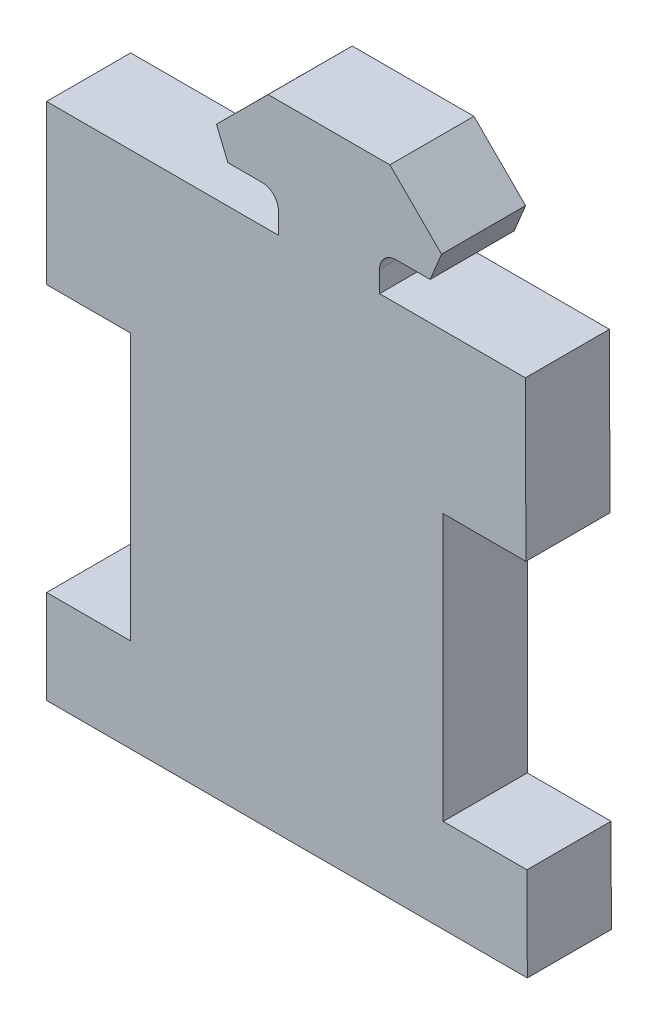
ISO-10303-21;
HEADER;
FILE_DESCRIPTION(('STEP AP214'),'2;1');
FILE_NAME('part.step','',(''),(''),'','','');
FILE_SCHEMA(('AUTOMOTIVE_DESIGN { 1 0 10303 214 1 1 1 1 }'));
ENDSEC;
DATA;
#1=APPLICATION_CONTEXT('core data for automotive mechanical design processes');
#2=APPLICATION_PROTOCOL_DEFINITION('international standard','automotive_design',2000,#1);
#3=PRODUCT_CONTEXT('',#1,'mechanical');
#4=PRODUCT('Part','Part','',(#3));
#5=PRODUCT_RELATED_PRODUCT_CATEGORY('part','',(#4));
#6=PRODUCT_DEFINITION_FORMATION('','',#4);
#7=PRODUCT_DEFINITION_CONTEXT('part definition',#1,'design');
#8=PRODUCT_DEFINITION('design','',#6,#7);
#9=PRODUCT_DEFINITION_SHAPE('','',#8);
#10=(LENGTH_UNIT() NAMED_UNIT(*) SI_UNIT(.MILLI.,.METRE.));
#11=(NAMED_UNIT(*) PLANE_ANGLE_UNIT() SI_UNIT($,.RADIAN.));
#12=(NAMED_UNIT(*) SI_UNIT($,.STERADIAN.) SOLID_ANGLE_UNIT());
#13=UNCERTAINTY_MEASURE_WITH_UNIT(LENGTH_MEASURE(1.E-05),#10,'distance_accuracy_value','');
#14=(GEOMETRIC_REPRESENTATION_CONTEXT(3) GLOBAL_UNCERTAINTY_ASSIGNED_CONTEXT((#13)) GLOBAL_UNIT_ASSIGNED_CONTEXT((#10,
#11,#12)) REPRESENTATION_CONTEXT('',''));
#15=CARTESIAN_POINT('',(0.,0.,0.));
#16=DIRECTION('',(0.,0.,1.));
#17=DIRECTION('',(1.,0.,0.));
#18=AXIS2_PLACEMENT_3D('',#15,#16,#17);
#19=CARTESIAN_POINT('',(-458.518450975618,-728.410011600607,5.3848));
#20=DIRECTION('',(1.,0.,0.));
#21=DIRECTION('',(0.,0.,-1.));
#22=AXIS2_PLACEMENT_3D('',#19,#20,#21);
#23=PLANE('',#22);
#24=DIRECTION('',(0.,-1.,0.));
#25=VECTOR('',#24,1.);
#26=CARTESIAN_POINT('',(-458.518450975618,-728.410011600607,5.3848));
#27=LINE('',#26,#25);
#28=CARTESIAN_POINT('',(-458.518450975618,-755.842088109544,5.3848));
#29=VERTEX_POINT('',#28);
#30=CARTESIAN_POINT('',(-458.518450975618,-761.832335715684,5.3848));
#31=VERTEX_POINT('',#30);
#32=EDGE_CURVE('E279',#29,#31,#27,.T.);
#33=ORIENTED_EDGE('',*,*,#32,.F.);
#34=DIRECTION('',(0.,0.,-1.));
#35=VECTOR('',#34,1.);
#36=CARTESIAN_POINT('',(-458.518450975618,-755.842088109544,23.2873866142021));
#37=LINE('',#36,#35);
#38=CARTESIAN_POINT('',(-458.518450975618,-755.842088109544,0.));
#39=VERTEX_POINT('',#38);
#40=EDGE_CURVE('E201',#29,#39,#37,.T.);
#41=ORIENTED_EDGE('',*,*,#40,.T.);
#42=DIRECTION('',(0.,-1.,0.));
#43=VECTOR('',#42,1.);
#44=CARTESIAN_POINT('',(-458.518450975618,-728.410011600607,0.));
#45=LINE('',#44,#43);
#46=CARTESIAN_POINT('',(-458.518450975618,-761.832335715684,0.));
#47=VERTEX_POINT('',#46);
#48=EDGE_CURVE('E275',#39,#47,#45,.T.);
#49=ORIENTED_EDGE('',*,*,#48,.T.);
#50=DIRECTION('',(0.,0.,-1.));
#51=VECTOR('',#50,1.);
#52=CARTESIAN_POINT('',(-458.518450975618,-761.832335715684,5.3848));
#53=LINE('',#52,#51);
#54=EDGE_CURVE('E40',#31,#47,#53,.T.);
#55=ORIENTED_EDGE('',*,*,#54,.F.);
#56=EDGE_LOOP('',(#33,#41,#49,#55));
#57=FACE_BOUND('',#56,.T.);
#58=ADVANCED_FACE('F32',(#57),#23,.F.);
#59=CARTESIAN_POINT('',(-427.733650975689,-761.832335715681,5.3848));
#60=DIRECTION('',(-0.999992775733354,-0.00380111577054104,0.));
#61=DIRECTION('',(0.00380111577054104,-0.999992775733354,0.));
#62=AXIS2_PLACEMENT_3D('',#59,#60,#61);
#63=PLANE('',#62);
#64=DIRECTION('',(-0.00380111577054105,0.999992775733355,0.));
#65=VECTOR('',#64,1.);
#66=CARTESIAN_POINT('',(-427.733650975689,-761.832335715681,0.));
#67=LINE('',#66,#65);
#68=CARTESIAN_POINT('',(-427.733650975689,-761.832335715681,0.));
#69=VERTEX_POINT('',#68);
#70=CARTESIAN_POINT('',(-427.756420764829,-755.842088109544,0.));
#71=VERTEX_POINT('',#70);
#72=EDGE_CURVE('E321',#69,#71,#67,.T.);
#73=ORIENTED_EDGE('',*,*,#72,.T.);
#74=DIRECTION('',(0.,0.,1.));
#75=VECTOR('',#74,1.);
#76=CARTESIAN_POINT('',(-427.756420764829,-755.842088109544,5.3848));
#77=LINE('',#76,#75);
#78=CARTESIAN_POINT('',(-427.756420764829,-755.842088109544,5.3848));
#79=VERTEX_POINT('',#78);
#80=EDGE_CURVE('E258',#71,#79,#77,.T.);
#81=ORIENTED_EDGE('',*,*,#80,.T.);
#82=DIRECTION('',(-0.00380111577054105,0.999992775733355,0.));
#83=VECTOR('',#82,1.);
#84=CARTESIAN_POINT('',(-427.733650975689,-761.832335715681,5.3848));
#85=LINE('',#84,#83);
#86=CARTESIAN_POINT('',(-427.733650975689,-761.832335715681,5.3848));
#87=VERTEX_POINT('',#86);
#88=EDGE_CURVE('E283',#87,#79,#85,.T.);
#89=ORIENTED_EDGE('',*,*,#88,.F.);
#90=DIRECTION('',(0.,0.,-1.));
#91=VECTOR('',#90,1.);
#92=CARTESIAN_POINT('',(-427.733650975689,-761.832335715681,5.3848));
#93=LINE('',#92,#91);
#94=EDGE_CURVE('E374',#87,#69,#93,.T.);
#95=ORIENTED_EDGE('',*,*,#94,.T.);
#96=EDGE_LOOP('',(#73,#81,#89,#95));
#97=FACE_BOUND('',#96,.T.);
#98=ADVANCED_FACE('F389',(#97),#63,.F.);
#99=CARTESIAN_POINT('',(-436.146138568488,-727.249300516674,0.));
#100=DIRECTION('',(0.,0.,1.));
#101=DIRECTION('',(1.,0.,0.));
#102=AXIS2_PLACEMENT_3D('',#99,#100,#101);
#103=PLANE('',#102);
#104=ORIENTED_EDGE('',*,*,#48,.F.);
#105=DIRECTION('',(-1.,0.,0.));
#106=VECTOR('',#105,1.);
#107=CARTESIAN_POINT('',(-458.518450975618,-755.842088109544,0.));
#108=LINE('',#107,#106);
#109=CARTESIAN_POINT('',(-453.133650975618,-755.842088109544,0.));
#110=VERTEX_POINT('',#109);
#111=EDGE_CURVE('E217',#110,#39,#108,.T.);
#112=ORIENTED_EDGE('',*,*,#111,.F.);
#113=DIRECTION('',(0.,-1.,0.));
#114=VECTOR('',#113,1.);
#115=CARTESIAN_POINT('',(-453.133650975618,-755.842088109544,0.));
#116=LINE('',#115,#114);
#117=CARTESIAN_POINT('',(-453.133650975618,-738.768525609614,0.));
#118=VERTEX_POINT('',#117);
#119=EDGE_CURVE('E211',#118,#110,#116,.T.);
#120=ORIENTED_EDGE('',*,*,#119,.F.);
#121=DIRECTION('',(1.,0.,0.));
#122=VECTOR('',#121,1.);
#123=CARTESIAN_POINT('',(-453.133650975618,-738.768525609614,0.));
#124=LINE('',#123,#122);
#125=CARTESIAN_POINT('',(-458.518450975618,-738.768525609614,0.));
#126=VERTEX_POINT('',#125);
#127=EDGE_CURVE('E222',#126,#118,#124,.T.);
#128=ORIENTED_EDGE('',*,*,#127,.F.);
#129=CARTESIAN_POINT('',(-458.518450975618,-728.608525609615,0.));
#130=VERTEX_POINT('',#129);
#131=EDGE_CURVE('E314',#130,#126,#45,.T.);
#132=ORIENTED_EDGE('',*,*,#131,.F.);
#133=DIRECTION('',(-1.,0.,0.));
#134=VECTOR('',#133,1.);
#135=CARTESIAN_POINT('',(-458.518450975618,-728.608525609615,0.));
#136=LINE('',#135,#134);
#137=CARTESIAN_POINT('',(-443.672150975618,-728.608525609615,0.));
#138=VERTEX_POINT('',#137);
#139=EDGE_CURVE('E229',#138,#130,#136,.T.);
#140=ORIENTED_EDGE('',*,*,#139,.F.);
#141=DIRECTION('',(0.,-1.,0.));
#142=VECTOR('',#141,1.);
#143=CARTESIAN_POINT('',(-443.672150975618,-727.249300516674,0.));
#144=LINE('',#143,#142);
#145=CARTESIAN_POINT('',(-443.672150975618,-727.249300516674,0.));
#146=VERTEX_POINT('',#145);
#147=EDGE_CURVE('E350',#146,#138,#144,.T.);
#148=ORIENTED_EDGE('',*,*,#147,.F.);
#149=CARTESIAN_POINT('',(-444.721163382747,-727.249300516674,0.));
#150=DIRECTION('',(0.,0.,-1.));
#151=DIRECTION('',(-1.,0.,0.));
#152=AXIS2_PLACEMENT_3D('',#149,#150,#151);
#153=CIRCLE('',#152,1.04901240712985);
#154=CARTESIAN_POINT('',(-444.721163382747,-726.200288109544,0.));
#155=VERTEX_POINT('',#154);
#156=EDGE_CURVE('E348',#155,#146,#153,.T.);
#157=ORIENTED_EDGE('',*,*,#156,.F.);
#158=DIRECTION('',(-1.,0.,0.));
#159=VECTOR('',#158,1.);
#160=CARTESIAN_POINT('',(-444.721163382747,-726.200288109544,0.));
#161=LINE('',#160,#159);
#162=CARTESIAN_POINT('',(-446.910439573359,-726.200288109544,0.));
#163=VERTEX_POINT('',#162);
#164=EDGE_CURVE('E345',#155,#163,#161,.T.);
#165=ORIENTED_EDGE('',*,*,#164,.T.);
#166=DIRECTION('',(-0.382154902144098,0.924098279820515,0.));
#167=VECTOR('',#166,1.);
#168=CARTESIAN_POINT('',(-446.910439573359,-726.200288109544,0.));
#169=LINE('',#168,#167);
#170=CARTESIAN_POINT('',(-447.640686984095,-724.434458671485,0.));
#171=VERTEX_POINT('',#170);
#172=EDGE_CURVE('E342',#163,#171,#169,.T.);
#173=ORIENTED_EDGE('',*,*,#172,.T.);
#174=DIRECTION('',(0.70791526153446,0.706297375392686,0.));
#175=VECTOR('',#174,1.);
#176=CARTESIAN_POINT('',(-447.640686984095,-724.434458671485,0.));
#177=LINE('',#176,#175);
#178=CARTESIAN_POINT('',(-444.331923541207,-721.133257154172,0.));
#179=VERTEX_POINT('',#178);
#180=EDGE_CURVE('E339',#171,#179,#177,.T.);
#181=ORIENTED_EDGE('',*,*,#180,.T.);
#182=DIRECTION('',(1.,0.,0.));
#183=VECTOR('',#182,1.);
#184=CARTESIAN_POINT('',(-444.331923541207,-721.133257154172,0.));
#185=LINE('',#184,#183);
#186=CARTESIAN_POINT('',(-436.535378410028,-721.133257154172,0.));
#187=VERTEX_POINT('',#186);
#188=EDGE_CURVE('E336',#179,#187,#185,.T.);
#189=ORIENTED_EDGE('',*,*,#188,.T.);
#190=DIRECTION('',(-0.70791526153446,0.706297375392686,0.));
#191=VECTOR('',#190,1.);
#192=CARTESIAN_POINT('',(-433.226614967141,-724.434458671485,0.));
#193=LINE('',#192,#191);
#194=CARTESIAN_POINT('',(-433.226614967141,-724.434458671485,0.));
#195=VERTEX_POINT('',#194);
#196=EDGE_CURVE('E333',#195,#187,#193,.T.);
#197=ORIENTED_EDGE('',*,*,#196,.F.);
#198=DIRECTION('',(0.382154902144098,0.924098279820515,0.));
#199=VECTOR('',#198,1.);
#200=CARTESIAN_POINT('',(-433.956862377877,-726.200288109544,0.));
#201=LINE('',#200,#199);
#202=CARTESIAN_POINT('',(-433.956862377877,-726.200288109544,0.));
#203=VERTEX_POINT('',#202);
#204=EDGE_CURVE('E331',#203,#195,#201,.T.);
#205=ORIENTED_EDGE('',*,*,#204,.F.);
#206=DIRECTION('',(1.,0.,0.));
#207=VECTOR('',#206,1.);
#208=CARTESIAN_POINT('',(-436.146138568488,-726.200288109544,0.));
#209=LINE('',#208,#207);
#210=CARTESIAN_POINT('',(-436.146138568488,-726.200288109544,0.));
#211=VERTEX_POINT('',#210);
#212=EDGE_CURVE('E329',#211,#203,#209,.T.);
#213=ORIENTED_EDGE('',*,*,#212,.F.);
#214=CARTESIAN_POINT('',(-436.146138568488,-727.249300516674,0.));
#215=DIRECTION('',(0.,0.,1.));
#216=DIRECTION('',(1.,0.,0.));
#217=AXIS2_PLACEMENT_3D('',#214,#215,#216);
#218=CIRCLE('',#217,1.04901240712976);
#219=CARTESIAN_POINT('',(-437.195150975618,-727.249300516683,0.));
#220=VERTEX_POINT('',#219);
#221=EDGE_CURVE('E326',#211,#220,#218,.T.);
#222=ORIENTED_EDGE('',*,*,#221,.T.);
#223=DIRECTION('',(0.,-1.,0.));
#224=VECTOR('',#223,1.);
#225=CARTESIAN_POINT('',(-437.195150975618,-727.249300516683,0.));
#226=LINE('',#225,#224);
#227=CARTESIAN_POINT('',(-437.195150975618,-728.608525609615,0.));
#228=VERTEX_POINT('',#227);
#229=EDGE_CURVE('E324',#220,#228,#226,.T.);
#230=ORIENTED_EDGE('',*,*,#229,.T.);
#231=DIRECTION('',(-0.999999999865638,-1.63927994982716E-05,0.));
#232=VECTOR('',#231,1.);
#233=CARTESIAN_POINT('',(-427.86069409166,-728.608372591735,0.));
#234=LINE('',#233,#232);
#235=CARTESIAN_POINT('',(-427.86069409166,-728.608372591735,0.));
#236=VERTEX_POINT('',#235);
#237=EDGE_CURVE('E262',#236,#228,#234,.T.);
#238=ORIENTED_EDGE('',*,*,#237,.F.);
#239=DIRECTION('',(-1.,0.,0.));
#240=VECTOR('',#239,1.);
#241=CARTESIAN_POINT('',(-427.613407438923,-728.608372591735,0.));
#242=LINE('',#241,#240);
#243=CARTESIAN_POINT('',(-427.859940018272,-728.608372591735,0.));
#244=VERTEX_POINT('',#243);
#245=EDGE_CURVE('E261',#244,#236,#242,.T.);
#246=ORIENTED_EDGE('',*,*,#245,.F.);
#247=CARTESIAN_POINT('',(-427.821319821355,-738.768525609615,0.));
#248=VERTEX_POINT('',#247);
#249=EDGE_CURVE('E320',#248,#244,#67,.T.);
#250=ORIENTED_EDGE('',*,*,#249,.F.);
#251=DIRECTION('',(1.,0.,0.));
#252=VECTOR('',#251,1.);
#253=CARTESIAN_POINT('',(-433.118450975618,-738.768525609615,0.));
#254=LINE('',#253,#252);
#255=CARTESIAN_POINT('',(-433.118450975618,-738.768525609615,0.));
#256=VERTEX_POINT('',#255);
#257=EDGE_CURVE('E238',#256,#248,#254,.T.);
#258=ORIENTED_EDGE('',*,*,#257,.F.);
#259=DIRECTION('',(0.,1.,0.));
#260=VECTOR('',#259,1.);
#261=CARTESIAN_POINT('',(-433.118450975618,-755.842088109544,0.));
#262=LINE('',#261,#260);
#263=CARTESIAN_POINT('',(-433.118450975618,-755.842088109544,0.));
#264=VERTEX_POINT('',#263);
#265=EDGE_CURVE('E241',#264,#256,#262,.T.);
#266=ORIENTED_EDGE('',*,*,#265,.F.);
#267=DIRECTION('',(-1.,0.,0.));
#268=VECTOR('',#267,1.);
#269=CARTESIAN_POINT('',(-427.733650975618,-755.842088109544,0.));
#270=LINE('',#269,#268);
#271=EDGE_CURVE('E235',#71,#264,#270,.T.);
#272=ORIENTED_EDGE('',*,*,#271,.F.);
#273=ORIENTED_EDGE('',*,*,#72,.F.);
#274=DIRECTION('',(-1.,-1.04585599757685E-13,0.));
#275=VECTOR('',#274,1.);
#276=CARTESIAN_POINT('',(-427.733650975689,-761.832335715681,0.));
#277=LINE('',#276,#275);
#278=EDGE_CURVE('E317',#69,#47,#277,.T.);
#279=ORIENTED_EDGE('',*,*,#278,.T.);
#280=EDGE_LOOP('',(#104,#112,#120,#128,#132,#140,#148,#157,#165,#173,#181,#189,#197,#205,#213,
#222,#230,#238,#246,#250,#258,#266,#272,#273,#279));
#281=FACE_BOUND('',#280,.T.);
#282=ADVANCED_FACE('F385',(#281),#103,.F.);
#283=ORIENTED_EDGE('',*,*,#131,.T.);
#284=DIRECTION('',(0.,0.,-1.));
#285=VECTOR('',#284,1.);
#286=CARTESIAN_POINT('',(-458.518450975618,-738.768525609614,23.2873866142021));
#287=LINE('',#286,#285);
#288=CARTESIAN_POINT('',(-458.518450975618,-738.768525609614,5.3848));
#289=VERTEX_POINT('',#288);
#290=EDGE_CURVE('E224',#289,#126,#287,.T.);
#291=ORIENTED_EDGE('',*,*,#290,.F.);
#292=CARTESIAN_POINT('',(-458.518450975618,-728.608525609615,5.3848));
#293=VERTEX_POINT('',#292);
#294=EDGE_CURVE('E276',#293,#289,#27,.T.);
#295=ORIENTED_EDGE('',*,*,#294,.F.);
#296=DIRECTION('',(0.,0.,-1.));
#297=VECTOR('',#296,1.);
#298=CARTESIAN_POINT('',(-458.518450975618,-728.608525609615,23.2873866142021));
#299=LINE('',#298,#297);
#300=EDGE_CURVE('E55',#293,#130,#299,.T.);
#301=ORIENTED_EDGE('',*,*,#300,.T.);
#302=EDGE_LOOP('',(#283,#291,#295,#301));
#303=FACE_BOUND('',#302,.T.);
#304=ADVANCED_FACE('F34',(#303),#23,.F.);
#305=CARTESIAN_POINT('',(-427.733650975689,-761.832335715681,5.3848));
#306=DIRECTION('',(1.04585599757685E-13,-1.,0.));
#307=DIRECTION('',(1.,1.04585599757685E-13,0.));
#308=AXIS2_PLACEMENT_3D('',#305,#306,#307);
#309=PLANE('',#308);
#310=ORIENTED_EDGE('',*,*,#278,.F.);
#311=ORIENTED_EDGE('',*,*,#94,.F.);
#312=DIRECTION('',(-1.,-1.04585599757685E-13,0.));
#313=VECTOR('',#312,1.);
#314=CARTESIAN_POINT('',(-427.733650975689,-761.832335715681,5.3848));
#315=LINE('',#314,#313);
#316=EDGE_CURVE('E278',#87,#31,#315,.T.);
#317=ORIENTED_EDGE('',*,*,#316,.T.);
#318=ORIENTED_EDGE('',*,*,#54,.T.);
#319=EDGE_LOOP('',(#310,#311,#317,#318));
#320=FACE_BOUND('',#319,.T.);
#321=ADVANCED_FACE('F379',(#320),#309,.T.);
#322=CARTESIAN_POINT('',(-427.821319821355,-738.768525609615,5.3848));
#323=VERTEX_POINT('',#322);
#324=CARTESIAN_POINT('',(-427.859940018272,-728.608372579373,5.3848));
#325=VERTEX_POINT('',#324);
#326=EDGE_CURVE('E282',#323,#325,#85,.T.);
#327=ORIENTED_EDGE('',*,*,#326,.F.);
#328=DIRECTION('',(0.,0.,-1.));
#329=VECTOR('',#328,1.);
#330=CARTESIAN_POINT('',(-427.821319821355,-738.768525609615,5.3848));
#331=LINE('',#330,#329);
#332=EDGE_CURVE('E248',#323,#248,#331,.T.);
#333=ORIENTED_EDGE('',*,*,#332,.T.);
#334=ORIENTED_EDGE('',*,*,#249,.T.);
#335=DIRECTION('',(0.,0.,1.));
#336=VECTOR('',#335,1.);
#337=CARTESIAN_POINT('',(-427.859940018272,-728.608372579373,5.3848));
#338=LINE('',#337,#336);
#339=EDGE_CURVE('E272',#244,#325,#338,.T.);
#340=ORIENTED_EDGE('',*,*,#339,.T.);
#341=EDGE_LOOP('',(#327,#333,#334,#340));
#342=FACE_BOUND('',#341,.T.);
#343=ADVANCED_FACE('F397',(#342),#63,.F.);
#344=CARTESIAN_POINT('',(-437.195150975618,-727.249300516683,5.3848));
#345=DIRECTION('',(1.,0.,0.));
#346=DIRECTION('',(0.,0.,-1.));
#347=AXIS2_PLACEMENT_3D('',#344,#345,#346);
#348=PLANE('',#347);
#349=DIRECTION('',(0.,-1.,0.));
#350=VECTOR('',#349,1.);
#351=CARTESIAN_POINT('',(-437.195150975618,-727.249300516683,5.3848));
#352=LINE('',#351,#350);
#353=CARTESIAN_POINT('',(-437.195150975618,-727.249300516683,5.3848));
#354=VERTEX_POINT('',#353);
#355=CARTESIAN_POINT('',(-437.195150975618,-728.608525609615,5.3848));
#356=VERTEX_POINT('',#355);
#357=EDGE_CURVE('E286',#354,#356,#352,.T.);
#358=ORIENTED_EDGE('',*,*,#357,.T.);
#359=DIRECTION('',(0.,0.,-1.));
#360=VECTOR('',#359,1.);
#361=CARTESIAN_POINT('',(-437.195150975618,-728.608525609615,23.2873866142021));
#362=LINE('',#361,#360);
#363=EDGE_CURVE('E269',#356,#228,#362,.T.);
#364=ORIENTED_EDGE('',*,*,#363,.T.);
#365=ORIENTED_EDGE('',*,*,#229,.F.);
#366=DIRECTION('',(0.,0.,-1.));
#367=VECTOR('',#366,1.);
#368=CARTESIAN_POINT('',(-437.195150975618,-727.249300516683,5.3848));
#369=LINE('',#368,#367);
#370=EDGE_CURVE('E372',#354,#220,#369,.T.);
#371=ORIENTED_EDGE('',*,*,#370,.F.);
#372=EDGE_LOOP('',(#358,#364,#365,#371));
#373=FACE_BOUND('',#372,.T.);
#374=ADVANCED_FACE('F481',(#373),#348,.T.);
#375=CARTESIAN_POINT('',(-436.146138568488,-727.249300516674,5.3848));
#376=DIRECTION('',(0.,0.,-1.));
#377=DIRECTION('',(-1.,0.,0.));
#378=AXIS2_PLACEMENT_3D('',#375,#376,#377);
#379=CYLINDRICAL_SURFACE('',#378,1.04901240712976);
#380=ORIENTED_EDGE('',*,*,#221,.F.);
#381=DIRECTION('',(0.,0.,-1.));
#382=VECTOR('',#381,1.);
#383=CARTESIAN_POINT('',(-436.146138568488,-726.200288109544,5.3848));
#384=LINE('',#383,#382);
#385=CARTESIAN_POINT('',(-436.146138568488,-726.200288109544,5.3848));
#386=VERTEX_POINT('',#385);
#387=EDGE_CURVE('E370',#386,#211,#384,.T.);
#388=ORIENTED_EDGE('',*,*,#387,.F.);
#389=CARTESIAN_POINT('',(-436.146138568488,-727.249300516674,5.3848));
#390=DIRECTION('',(0.,0.,1.));
#391=DIRECTION('',(1.,0.,0.));
#392=AXIS2_PLACEMENT_3D('',#389,#390,#391);
#393=CIRCLE('',#392,1.04901240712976);
#394=EDGE_CURVE('E288',#386,#354,#393,.T.);
#395=ORIENTED_EDGE('',*,*,#394,.T.);
#396=ORIENTED_EDGE('',*,*,#370,.T.);
#397=EDGE_LOOP('',(#380,#388,#395,#396));
#398=FACE_BOUND('',#397,.T.);
#399=ADVANCED_FACE('F477',(#398),#379,.F.);
#400=CARTESIAN_POINT('',(-436.146138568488,-726.200288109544,5.3848));
#401=DIRECTION('',(0.,1.,0.));
#402=DIRECTION('',(0.,0.,1.));
#403=AXIS2_PLACEMENT_3D('',#400,#401,#402);
#404=PLANE('',#403);
#405=ORIENTED_EDGE('',*,*,#212,.T.);
#406=DIRECTION('',(0.,0.,-1.));
#407=VECTOR('',#406,1.);
#408=CARTESIAN_POINT('',(-433.956862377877,-726.200288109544,5.3848));
#409=LINE('',#408,#407);
#410=CARTESIAN_POINT('',(-433.956862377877,-726.200288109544,5.3848));
#411=VERTEX_POINT('',#410);
#412=EDGE_CURVE('E367',#411,#203,#409,.T.);
#413=ORIENTED_EDGE('',*,*,#412,.F.);
#414=DIRECTION('',(1.,0.,0.));
#415=VECTOR('',#414,1.);
#416=CARTESIAN_POINT('',(-436.146138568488,-726.200288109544,5.3848));
#417=LINE('',#416,#415);
#418=EDGE_CURVE('E291',#386,#411,#417,.T.);
#419=ORIENTED_EDGE('',*,*,#418,.F.);
#420=ORIENTED_EDGE('',*,*,#387,.T.);
#421=EDGE_LOOP('',(#405,#413,#419,#420));
#422=FACE_BOUND('',#421,.T.);
#423=ADVANCED_FACE('F473',(#422),#404,.F.);
#424=CARTESIAN_POINT('',(-433.956862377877,-726.200288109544,5.3848));
#425=DIRECTION('',(-0.924098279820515,0.382154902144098,0.));
#426=DIRECTION('',(-0.382154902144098,-0.924098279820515,0.));
#427=AXIS2_PLACEMENT_3D('',#424,#425,#426);
#428=PLANE('',#427);
#429=ORIENTED_EDGE('',*,*,#204,.T.);
#430=DIRECTION('',(0.,0.,-1.));
#431=VECTOR('',#430,1.);
#432=CARTESIAN_POINT('',(-433.226614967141,-724.434458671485,5.3848));
#433=LINE('',#432,#431);
#434=CARTESIAN_POINT('',(-433.226614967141,-724.434458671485,5.3848));
#435=VERTEX_POINT('',#434);
#436=EDGE_CURVE('E364',#435,#195,#433,.T.);
#437=ORIENTED_EDGE('',*,*,#436,.F.);
#438=DIRECTION('',(0.382154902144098,0.924098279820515,0.));
#439=VECTOR('',#438,1.);
#440=CARTESIAN_POINT('',(-433.956862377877,-726.200288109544,5.3848));
#441=LINE('',#440,#439);
#442=EDGE_CURVE('E293',#411,#435,#441,.T.);
#443=ORIENTED_EDGE('',*,*,#442,.F.);
#444=ORIENTED_EDGE('',*,*,#412,.T.);
#445=EDGE_LOOP('',(#429,#437,#443,#444));
#446=FACE_BOUND('',#445,.T.);
#447=ADVANCED_FACE('F469',(#446),#428,.F.);
#448=CARTESIAN_POINT('',(-433.226614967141,-724.434458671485,5.3848));
#449=DIRECTION('',(-0.706297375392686,-0.70791526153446,0.));
#450=DIRECTION('',(0.70791526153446,-0.706297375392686,0.));
#451=AXIS2_PLACEMENT_3D('',#448,#449,#450);
#452=PLANE('',#451);
#453=ORIENTED_EDGE('',*,*,#196,.T.);
#454=DIRECTION('',(0.,0.,-1.));
#455=VECTOR('',#454,1.);
#456=CARTESIAN_POINT('',(-436.535378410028,-721.133257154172,5.3848));
#457=LINE('',#456,#455);
#458=CARTESIAN_POINT('',(-436.535378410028,-721.133257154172,5.3848));
#459=VERTEX_POINT('',#458);
#460=EDGE_CURVE('E362',#459,#187,#457,.T.);
#461=ORIENTED_EDGE('',*,*,#460,.F.);
#462=DIRECTION('',(-0.70791526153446,0.706297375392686,0.));
#463=VECTOR('',#462,1.);
#464=CARTESIAN_POINT('',(-433.226614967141,-724.434458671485,5.3848));
#465=LINE('',#464,#463);
#466=EDGE_CURVE('E295',#435,#459,#465,.T.);
#467=ORIENTED_EDGE('',*,*,#466,.F.);
#468=ORIENTED_EDGE('',*,*,#436,.T.);
#469=EDGE_LOOP('',(#453,#461,#467,#468));
#470=FACE_BOUND('',#469,.T.);
#471=ADVANCED_FACE('F465',(#470),#452,.F.);
#472=CARTESIAN_POINT('',(-444.331923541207,-721.133257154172,5.3848));
#473=DIRECTION('',(0.,1.,0.));
#474=DIRECTION('',(0.,0.,1.));
#475=AXIS2_PLACEMENT_3D('',#472,#473,#474);
#476=PLANE('',#475);
#477=ORIENTED_EDGE('',*,*,#188,.F.);
#478=DIRECTION('',(0.,0.,-1.));
#479=VECTOR('',#478,1.);
#480=CARTESIAN_POINT('',(-444.331923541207,-721.133257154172,5.3848));
#481=LINE('',#480,#479);
#482=CARTESIAN_POINT('',(-444.331923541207,-721.133257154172,5.3848));
#483=VERTEX_POINT('',#482);
#484=EDGE_CURVE('E360',#483,#179,#481,.T.);
#485=ORIENTED_EDGE('',*,*,#484,.F.);
#486=DIRECTION('',(1.,0.,0.));
#487=VECTOR('',#486,1.);
#488=CARTESIAN_POINT('',(-444.331923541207,-721.133257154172,5.3848));
#489=LINE('',#488,#487);
#490=EDGE_CURVE('E297',#483,#459,#489,.T.);
#491=ORIENTED_EDGE('',*,*,#490,.T.);
#492=ORIENTED_EDGE('',*,*,#460,.T.);
#493=EDGE_LOOP('',(#477,#485,#491,#492));
#494=FACE_BOUND('',#493,.T.);
#495=ADVANCED_FACE('F461',(#494),#476,.T.);
#496=CARTESIAN_POINT('',(-447.640686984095,-724.434458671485,5.3848));
#497=DIRECTION('',(-0.706297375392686,0.70791526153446,0.));
#498=DIRECTION('',(-0.70791526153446,-0.706297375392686,0.));
#499=AXIS2_PLACEMENT_3D('',#496,#497,#498);
#500=PLANE('',#499);
#501=ORIENTED_EDGE('',*,*,#180,.F.);
#502=DIRECTION('',(0.,0.,-1.));
#503=VECTOR('',#502,1.);
#504=CARTESIAN_POINT('',(-447.640686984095,-724.434458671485,5.3848));
#505=LINE('',#504,#503);
#506=CARTESIAN_POINT('',(-447.640686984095,-724.434458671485,5.3848));
#507=VERTEX_POINT('',#506);
#508=EDGE_CURVE('E358',#507,#171,#505,.T.);
#509=ORIENTED_EDGE('',*,*,#508,.F.);
#510=DIRECTION('',(0.70791526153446,0.706297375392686,0.));
#511=VECTOR('',#510,1.);
#512=CARTESIAN_POINT('',(-447.640686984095,-724.434458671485,5.3848));
#513=LINE('',#512,#511);
#514=EDGE_CURVE('E300',#507,#483,#513,.T.);
#515=ORIENTED_EDGE('',*,*,#514,.T.);
#516=ORIENTED_EDGE('',*,*,#484,.T.);
#517=EDGE_LOOP('',(#501,#509,#515,#516));
#518=FACE_BOUND('',#517,.T.);
#519=ADVANCED_FACE('F457',(#518),#500,.T.);
#520=CARTESIAN_POINT('',(-446.910439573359,-726.200288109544,5.3848));
#521=DIRECTION('',(-0.924098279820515,-0.382154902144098,0.));
#522=DIRECTION('',(0.382154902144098,-0.924098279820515,0.));
#523=AXIS2_PLACEMENT_3D('',#520,#521,#522);
#524=PLANE('',#523);
#525=ORIENTED_EDGE('',*,*,#172,.F.);
#526=DIRECTION('',(0.,0.,-1.));
#527=VECTOR('',#526,1.);
#528=CARTESIAN_POINT('',(-446.910439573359,-726.200288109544,5.3848));
#529=LINE('',#528,#527);
#530=CARTESIAN_POINT('',(-446.910439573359,-726.200288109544,5.3848));
#531=VERTEX_POINT('',#530);
#532=EDGE_CURVE('E356',#531,#163,#529,.T.);
#533=ORIENTED_EDGE('',*,*,#532,.F.);
#534=DIRECTION('',(-0.382154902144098,0.924098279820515,0.));
#535=VECTOR('',#534,1.);
#536=CARTESIAN_POINT('',(-446.910439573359,-726.200288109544,5.3848));
#537=LINE('',#536,#535);
#538=EDGE_CURVE('E303',#531,#507,#537,.T.);
#539=ORIENTED_EDGE('',*,*,#538,.T.);
#540=ORIENTED_EDGE('',*,*,#508,.T.);
#541=EDGE_LOOP('',(#525,#533,#539,#540));
#542=FACE_BOUND('',#541,.T.);
#543=ADVANCED_FACE('F453',(#542),#524,.T.);
#544=CARTESIAN_POINT('',(-444.721163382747,-726.200288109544,5.3848));
#545=DIRECTION('',(0.,-1.,0.));
#546=DIRECTION('',(0.,0.,-1.));
#547=AXIS2_PLACEMENT_3D('',#544,#545,#546);
#548=PLANE('',#547);
#549=ORIENTED_EDGE('',*,*,#164,.F.);
#550=DIRECTION('',(0.,0.,-1.));
#551=VECTOR('',#550,1.);
#552=CARTESIAN_POINT('',(-444.721163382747,-726.200288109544,5.3848));
#553=LINE('',#552,#551);
#554=CARTESIAN_POINT('',(-444.721163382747,-726.200288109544,5.3848));
#555=VERTEX_POINT('',#554);
#556=EDGE_CURVE('E354',#555,#155,#553,.T.);
#557=ORIENTED_EDGE('',*,*,#556,.F.);
#558=DIRECTION('',(-1.,0.,0.));
#559=VECTOR('',#558,1.);
#560=CARTESIAN_POINT('',(-444.721163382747,-726.200288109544,5.3848));
#561=LINE('',#560,#559);
#562=EDGE_CURVE('E306',#555,#531,#561,.T.);
#563=ORIENTED_EDGE('',*,*,#562,.T.);
#564=ORIENTED_EDGE('',*,*,#532,.T.);
#565=EDGE_LOOP('',(#549,#557,#563,#564));
#566=FACE_BOUND('',#565,.T.);
#567=ADVANCED_FACE('F449',(#566),#548,.T.);
#568=CARTESIAN_POINT('',(-444.721163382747,-727.249300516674,5.3848));
#569=DIRECTION('',(0.,0.,-1.));
#570=DIRECTION('',(-1.,0.,0.));
#571=AXIS2_PLACEMENT_3D('',#568,#569,#570);
#572=CYLINDRICAL_SURFACE('',#571,1.04901240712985);
#573=ORIENTED_EDGE('',*,*,#156,.T.);
#574=DIRECTION('',(0.,0.,-1.));
#575=VECTOR('',#574,1.);
#576=CARTESIAN_POINT('',(-443.672150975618,-727.249300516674,5.3848));
#577=LINE('',#576,#575);
#578=CARTESIAN_POINT('',(-443.672150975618,-727.249300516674,5.3848));
#579=VERTEX_POINT('',#578);
#580=EDGE_CURVE('E313',#579,#146,#577,.T.);
#581=ORIENTED_EDGE('',*,*,#580,.F.);
#582=CARTESIAN_POINT('',(-444.721163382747,-727.249300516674,5.3848));
#583=DIRECTION('',(0.,0.,-1.));
#584=DIRECTION('',(-1.,0.,0.));
#585=AXIS2_PLACEMENT_3D('',#582,#583,#584);
#586=CIRCLE('',#585,1.04901240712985);
#587=EDGE_CURVE('E309',#555,#579,#586,.T.);
#588=ORIENTED_EDGE('',*,*,#587,.F.);
#589=ORIENTED_EDGE('',*,*,#556,.T.);
#590=EDGE_LOOP('',(#573,#581,#588,#589));
#591=FACE_BOUND('',#590,.T.);
#592=ADVANCED_FACE('F445',(#591),#572,.F.);
#593=CARTESIAN_POINT('',(-443.672150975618,-727.249300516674,5.3848));
#594=DIRECTION('',(1.,0.,0.));
#595=DIRECTION('',(0.,0.,-1.));
#596=AXIS2_PLACEMENT_3D('',#593,#594,#595);
#597=PLANE('',#596);
#598=ORIENTED_EDGE('',*,*,#147,.T.);
#599=DIRECTION('',(0.,0.,-1.));
#600=VECTOR('',#599,1.);
#601=CARTESIAN_POINT('',(-443.672150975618,-728.608525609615,23.2873866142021));
#602=LINE('',#601,#600);
#603=CARTESIAN_POINT('',(-443.672150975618,-728.608525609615,5.3848));
#604=VERTEX_POINT('',#603);
#605=EDGE_CURVE('E231',#604,#138,#602,.T.);
#606=ORIENTED_EDGE('',*,*,#605,.F.);
#607=DIRECTION('',(0.,-1.,0.));
#608=VECTOR('',#607,1.);
#609=CARTESIAN_POINT('',(-443.672150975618,-727.249300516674,5.3848));
#610=LINE('',#609,#608);
#611=EDGE_CURVE('E311',#579,#604,#610,.T.);
#612=ORIENTED_EDGE('',*,*,#611,.F.);
#613=ORIENTED_EDGE('',*,*,#580,.T.);
#614=EDGE_LOOP('',(#598,#606,#612,#613));
#615=FACE_BOUND('',#614,.T.);
#616=ADVANCED_FACE('F441',(#615),#597,.F.);
#617=CARTESIAN_POINT('',(-436.146138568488,-727.249300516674,5.3848));
#618=DIRECTION('',(0.,0.,1.));
#619=DIRECTION('',(1.,0.,0.));
#620=AXIS2_PLACEMENT_3D('',#617,#618,#619);
#621=PLANE('',#620);
#622=DIRECTION('',(-1.,0.,0.));
#623=VECTOR('',#622,1.);
#624=CARTESIAN_POINT('',(-458.518450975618,-755.842088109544,5.3848));
#625=LINE('',#624,#623);
#626=CARTESIAN_POINT('',(-453.133650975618,-755.842088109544,5.38480000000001));
#627=VERTEX_POINT('',#626);
#628=EDGE_CURVE('E195',#627,#29,#625,.T.);
#629=ORIENTED_EDGE('',*,*,#628,.T.);
#630=ORIENTED_EDGE('',*,*,#32,.T.);
#631=ORIENTED_EDGE('',*,*,#316,.F.);
#632=ORIENTED_EDGE('',*,*,#88,.T.);
#633=DIRECTION('',(1.,0.,0.));
#634=VECTOR('',#633,1.);
#635=CARTESIAN_POINT('',(-436.146138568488,-755.842088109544,5.3848));
#636=LINE('',#635,#634);
#637=CARTESIAN_POINT('',(-433.118450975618,-755.842088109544,5.38480000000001));
#638=VERTEX_POINT('',#637);
#639=EDGE_CURVE('E11',#638,#79,#636,.T.);
#640=ORIENTED_EDGE('',*,*,#639,.F.);
#641=DIRECTION('',(0.,1.,0.));
#642=VECTOR('',#641,1.);
#643=CARTESIAN_POINT('',(-433.118450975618,-755.842088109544,5.3848));
#644=LINE('',#643,#642);
#645=CARTESIAN_POINT('',(-433.118450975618,-738.768525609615,5.3848));
#646=VERTEX_POINT('',#645);
#647=EDGE_CURVE('E250',#638,#646,#644,.T.);
#648=ORIENTED_EDGE('',*,*,#647,.T.);
#649=DIRECTION('',(1.,0.,0.));
#650=VECTOR('',#649,1.);
#651=CARTESIAN_POINT('',(-433.118450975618,-738.768525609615,5.3848));
#652=LINE('',#651,#650);
#653=EDGE_CURVE('E245',#646,#323,#652,.T.);
#654=ORIENTED_EDGE('',*,*,#653,.T.);
#655=ORIENTED_EDGE('',*,*,#326,.T.);
#656=DIRECTION('',(-0.999999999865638,-1.63927994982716E-05,0.));
#657=VECTOR('',#656,1.);
#658=CARTESIAN_POINT('',(-427.86069409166,-728.608372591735,5.3848));
#659=LINE('',#658,#657);
#660=EDGE_CURVE('E265',#325,#356,#659,.T.);
#661=ORIENTED_EDGE('',*,*,#660,.T.);
#662=ORIENTED_EDGE('',*,*,#357,.F.);
#663=ORIENTED_EDGE('',*,*,#394,.F.);
#664=ORIENTED_EDGE('',*,*,#418,.T.);
#665=ORIENTED_EDGE('',*,*,#442,.T.);
#666=ORIENTED_EDGE('',*,*,#466,.T.);
#667=ORIENTED_EDGE('',*,*,#490,.F.);
#668=ORIENTED_EDGE('',*,*,#514,.F.);
#669=ORIENTED_EDGE('',*,*,#538,.F.);
#670=ORIENTED_EDGE('',*,*,#562,.F.);
#671=ORIENTED_EDGE('',*,*,#587,.T.);
#672=ORIENTED_EDGE('',*,*,#611,.T.);
#673=DIRECTION('',(-1.,0.,0.));
#674=VECTOR('',#673,1.);
#675=CARTESIAN_POINT('',(-458.518450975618,-728.608525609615,5.3848));
#676=LINE('',#675,#674);
#677=EDGE_CURVE('E232',#604,#293,#676,.T.);
#678=ORIENTED_EDGE('',*,*,#677,.T.);
#679=ORIENTED_EDGE('',*,*,#294,.T.);
#680=DIRECTION('',(1.,0.,0.));
#681=VECTOR('',#680,1.);
#682=CARTESIAN_POINT('',(-453.133650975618,-738.768525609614,5.3848));
#683=LINE('',#682,#681);
#684=CARTESIAN_POINT('',(-453.133650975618,-738.768525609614,5.3848));
#685=VERTEX_POINT('',#684);
#686=EDGE_CURVE('E216',#289,#685,#683,.T.);
#687=ORIENTED_EDGE('',*,*,#686,.T.);
#688=DIRECTION('',(0.,-1.,0.));
#689=VECTOR('',#688,1.);
#690=CARTESIAN_POINT('',(-453.133650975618,-755.842088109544,5.3848));
#691=LINE('',#690,#689);
#692=EDGE_CURVE('E208',#685,#627,#691,.T.);
#693=ORIENTED_EDGE('',*,*,#692,.T.);
#694=EDGE_LOOP('',(#629,#630,#631,#632,#640,#648,#654,#655,#661,#662,#663,#664,#665,#666,#667,
#668,#669,#670,#671,#672,#678,#679,#687,#693));
#695=FACE_BOUND('',#694,.T.);
#696=ADVANCED_FACE('F214',(#695),#621,.T.);
#697=CARTESIAN_POINT('',(-427.86069409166,-728.608372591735,23.2873866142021));
#698=DIRECTION('',(1.63927994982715E-05,-0.999999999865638,0.));
#699=DIRECTION('',(0.999999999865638,1.63927994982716E-05,0.));
#700=AXIS2_PLACEMENT_3D('',#697,#698,#699);
#701=PLANE('',#700);
#702=ORIENTED_EDGE('',*,*,#245,.T.);
#703=ORIENTED_EDGE('',*,*,#237,.T.);
#704=ORIENTED_EDGE('',*,*,#363,.F.);
#705=ORIENTED_EDGE('',*,*,#660,.F.);
#706=ORIENTED_EDGE('',*,*,#339,.F.);
#707=EDGE_LOOP('',(#702,#703,#704,#705,#706));
#708=FACE_BOUND('',#707,.T.);
#709=ADVANCED_FACE('F435',(#708),#701,.F.);
#710=CARTESIAN_POINT('',(-427.733650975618,-755.842088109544,23.2873866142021));
#711=DIRECTION('',(0.,-1.,0.));
#712=DIRECTION('',(0.,0.,-1.));
#713=AXIS2_PLACEMENT_3D('',#710,#711,#712);
#714=PLANE('',#713);
#715=ORIENTED_EDGE('',*,*,#271,.T.);
#716=DIRECTION('',(0.,0.,-1.));
#717=VECTOR('',#716,1.);
#718=CARTESIAN_POINT('',(-433.118450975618,-755.842088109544,23.2873866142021));
#719=LINE('',#718,#717);
#720=EDGE_CURVE('E240',#638,#264,#719,.T.);
#721=ORIENTED_EDGE('',*,*,#720,.F.);
#722=ORIENTED_EDGE('',*,*,#639,.T.);
#723=ORIENTED_EDGE('',*,*,#80,.F.);
#724=EDGE_LOOP('',(#715,#721,#722,#723));
#725=FACE_BOUND('',#724,.T.);
#726=ADVANCED_FACE('F428',(#725),#714,.F.);
#727=CARTESIAN_POINT('',(-433.118450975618,-738.768525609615,23.2873866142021));
#728=DIRECTION('',(0.,1.,0.));
#729=DIRECTION('',(0.,0.,1.));
#730=AXIS2_PLACEMENT_3D('',#727,#728,#729);
#731=PLANE('',#730);
#732=ORIENTED_EDGE('',*,*,#653,.F.);
#733=DIRECTION('',(0.,0.,-1.));
#734=VECTOR('',#733,1.);
#735=CARTESIAN_POINT('',(-433.118450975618,-738.768525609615,23.2873866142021));
#736=LINE('',#735,#734);
#737=EDGE_CURVE('E249',#646,#256,#736,.T.);
#738=ORIENTED_EDGE('',*,*,#737,.T.);
#739=ORIENTED_EDGE('',*,*,#257,.T.);
#740=ORIENTED_EDGE('',*,*,#332,.F.);
#741=EDGE_LOOP('',(#732,#738,#739,#740));
#742=FACE_BOUND('',#741,.T.);
#743=ADVANCED_FACE('F425',(#742),#731,.F.);
#744=CARTESIAN_POINT('',(-433.118450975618,-755.842088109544,23.2873866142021));
#745=DIRECTION('',(-1.,0.,0.));
#746=DIRECTION('',(0.,0.,1.));
#747=AXIS2_PLACEMENT_3D('',#744,#745,#746);
#748=PLANE('',#747);
#749=ORIENTED_EDGE('',*,*,#720,.T.);
#750=ORIENTED_EDGE('',*,*,#265,.T.);
#751=ORIENTED_EDGE('',*,*,#737,.F.);
#752=ORIENTED_EDGE('',*,*,#647,.F.);
#753=EDGE_LOOP('',(#749,#750,#751,#752));
#754=FACE_BOUND('',#753,.T.);
#755=ADVANCED_FACE('F424',(#754),#748,.F.);
#756=CARTESIAN_POINT('',(-458.518450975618,-728.608525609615,23.2873866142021));
#757=DIRECTION('',(0.,-1.,0.));
#758=DIRECTION('',(0.,0.,-1.));
#759=AXIS2_PLACEMENT_3D('',#756,#757,#758);
#760=PLANE('',#759);
#761=ORIENTED_EDGE('',*,*,#605,.T.);
#762=ORIENTED_EDGE('',*,*,#139,.T.);
#763=ORIENTED_EDGE('',*,*,#300,.F.);
#764=ORIENTED_EDGE('',*,*,#677,.F.);
#765=EDGE_LOOP('',(#761,#762,#763,#764));
#766=FACE_BOUND('',#765,.T.);
#767=ADVANCED_FACE('F421',(#766),#760,.F.);
#768=CARTESIAN_POINT('',(-453.133650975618,-755.842088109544,23.2873866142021));
#769=DIRECTION('',(1.,0.,0.));
#770=DIRECTION('',(0.,1.,0.));
#771=AXIS2_PLACEMENT_3D('',#768,#769,#770);
#772=PLANE('',#771);
#773=DIRECTION('',(0.,0.,-1.));
#774=VECTOR('',#773,1.);
#775=CARTESIAN_POINT('',(-453.133650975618,-738.768525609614,23.2873866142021));
#776=LINE('',#775,#774);
#777=EDGE_CURVE('E47',#685,#118,#776,.T.);
#778=ORIENTED_EDGE('',*,*,#777,.T.);
#779=ORIENTED_EDGE('',*,*,#119,.T.);
#780=DIRECTION('',(0.,0.,-1.));
#781=VECTOR('',#780,1.);
#782=CARTESIAN_POINT('',(-453.133650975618,-755.842088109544,23.2873866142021));
#783=LINE('',#782,#781);
#784=EDGE_CURVE('E198',#627,#110,#783,.T.);
#785=ORIENTED_EDGE('',*,*,#784,.F.);
#786=ORIENTED_EDGE('',*,*,#692,.F.);
#787=EDGE_LOOP('',(#778,#779,#785,#786));
#788=FACE_BOUND('',#787,.T.);
#789=ADVANCED_FACE('F207',(#788),#772,.F.);
#790=CARTESIAN_POINT('',(-458.518450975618,-755.842088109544,23.2873866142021));
#791=DIRECTION('',(0.,-1.,0.));
#792=DIRECTION('',(0.,0.,-1.));
#793=AXIS2_PLACEMENT_3D('',#790,#791,#792);
#794=PLANE('',#793);
#795=ORIENTED_EDGE('',*,*,#784,.T.);
#796=ORIENTED_EDGE('',*,*,#111,.T.);
#797=ORIENTED_EDGE('',*,*,#40,.F.);
#798=ORIENTED_EDGE('',*,*,#628,.F.);
#799=EDGE_LOOP('',(#795,#796,#797,#798));
#800=FACE_BOUND('',#799,.T.);
#801=ADVANCED_FACE('F197',(#800),#794,.F.);
#802=CARTESIAN_POINT('',(-453.133650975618,-738.768525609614,23.2873866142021));
#803=DIRECTION('',(0.,1.,0.));
#804=DIRECTION('',(0.,0.,1.));
#805=AXIS2_PLACEMENT_3D('',#802,#803,#804);
#806=PLANE('',#805);
#807=ORIENTED_EDGE('',*,*,#290,.T.);
#808=ORIENTED_EDGE('',*,*,#127,.T.);
#809=ORIENTED_EDGE('',*,*,#777,.F.);
#810=ORIENTED_EDGE('',*,*,#686,.F.);
#811=EDGE_LOOP('',(#807,#808,#809,#810));
#812=FACE_BOUND('',#811,.T.);
#813=ADVANCED_FACE('F411',(#812),#806,.F.);
#814=CLOSED_SHELL('',(#58,#98,#282,#304,#321,#343,#374,#399,#423,#447,#471,#495,#519,#543,#567,
#592,#616,#696,#709,#726,#743,#755,#767,#789,#801,#813));
#815=MANIFOLD_SOLID_BREP('B2',#814);
#816=ADVANCED_BREP_SHAPE_REPRESENTATION('',(#18,#815),#14);
#817=SHAPE_DEFINITION_REPRESENTATION(#9,#816);
ENDSEC;
END-ISO-10303-21;
